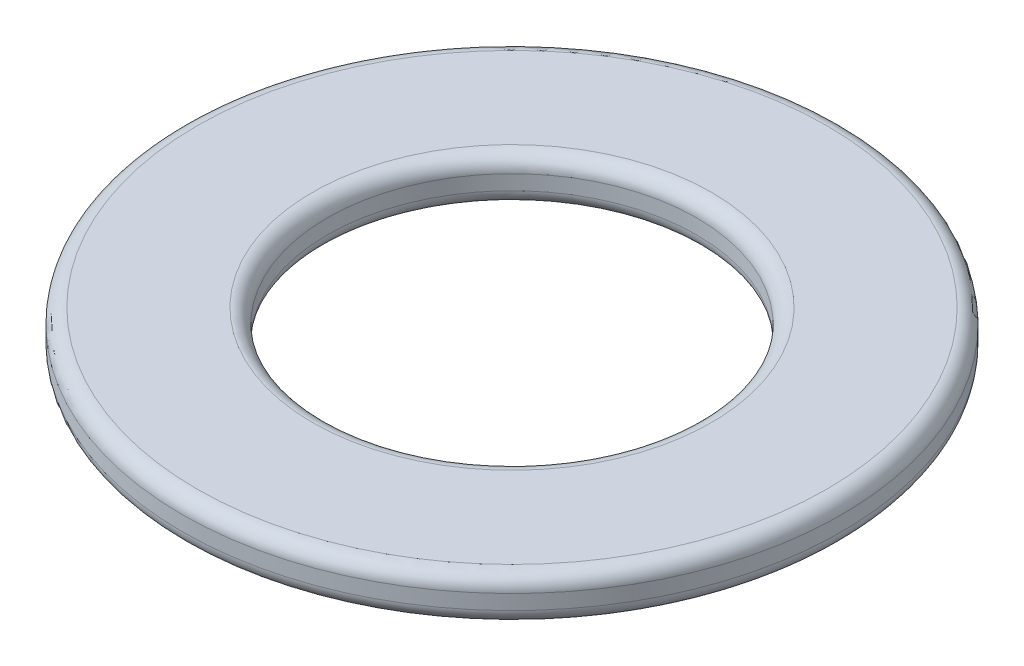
from build123d import *

# Parameters (mm, degrees)
SKETCH1_R           = 22.316909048
SKETCH1_R_2         = 12.507953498
BOSS_EXTRUDE1_DEPTH = 3
FILLET1_R           = 1
FILLET2_R           = 1
FILLET3_R           = 1
FILLET4_R           = 1


with BuildPart() as part:
    # Sketch1 → Boss-Extrude1 (new body)
    with BuildSketch(Plane(origin=(0, 0, 0), x_dir=(1, 0, 0), z_dir=(0, 1, 0))):
        with Locations(Location((0, 0, 0), (0, 0, 270))):
            Circle(SKETCH1_R)
        with Locations(Location((0, 0, 0), (0, 0, 270))):
            Circle(SKETCH1_R_2, mode=Mode.SUBTRACT)
    extrude(amount=BOSS_EXTRUDE1_DEPTH)

    # Fillet1
    fillet1_edges = [part.edges().sort_by_distance(p)[0] for p in [
        (0, 3, -22.316909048),
    ]]
    fillet(fillet1_edges, radius=FILLET1_R)

    # Fillet2
    fillet2_edges = [part.edges().sort_by_distance(p)[0] for p in [
        (0, 0, -22.316909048),
    ]]
    fillet(fillet2_edges, radius=FILLET2_R)

    # Fillet3
    fillet3_edges = [part.edges().sort_by_distance(p)[0] for p in [
        (0, 3, -12.507953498),
    ]]
    fillet(fillet3_edges, radius=FILLET3_R)

    # Fillet4
    fillet4_edges = [part.edges().sort_by_distance(p)[0] for p in [
        (0, 0, -12.507953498),
    ]]
    fillet(fillet4_edges, radius=FILLET4_R)


solid = part.part
